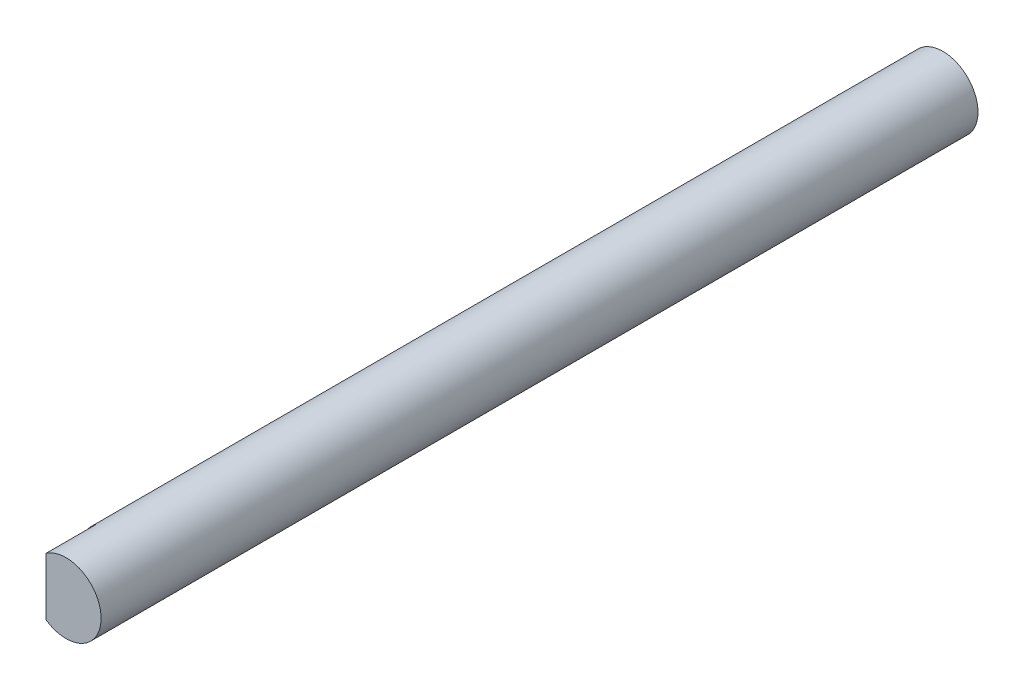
from build123d import *

# Parameters (mm, degrees)
SKETCH1_R          = 7
EXTRUDE1_DEPTH     = 175
SKETCH2_W          = 3
SKETCH2_H          = 28.099377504
CUT_EXTRUDE1_DEPTH = 10


with BuildPart() as part:
    # Sketch1 → Extrude1 (new body)
    with BuildSketch(Plane.XY):
        Circle(SKETCH1_R)
    extrude(amount=EXTRUDE1_DEPTH)

    # Sketch2 → Cut-Extrude1 (cut)
    with BuildSketch(Plane.XY.offset(175)):
        with Locations((-5.5, -3.235644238)):
            Rectangle(SKETCH2_W, SKETCH2_H)
    extrude(amount=-CUT_EXTRUDE1_DEPTH, mode=Mode.SUBTRACT)


solid = part.part
